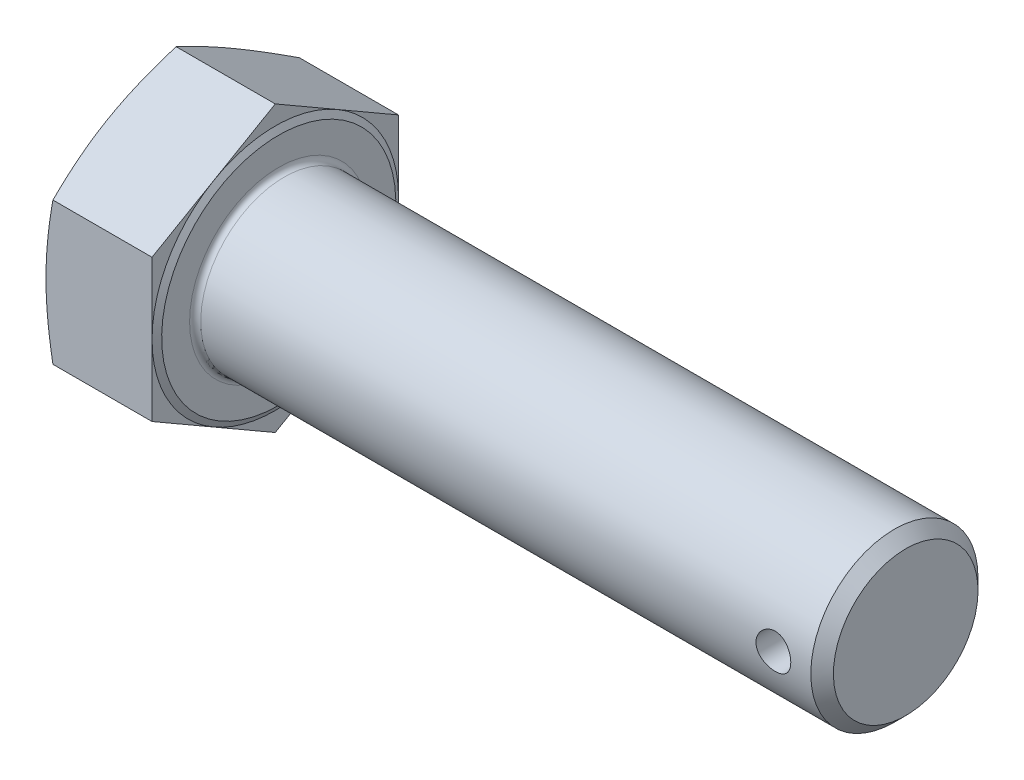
ISO-10303-21;
HEADER;
FILE_DESCRIPTION(('STEP AP214'),'2;1');
FILE_NAME('part.step','',(''),(''),'','','');
FILE_SCHEMA(('AUTOMOTIVE_DESIGN { 1 0 10303 214 1 1 1 1 }'));
ENDSEC;
DATA;
#1=APPLICATION_CONTEXT('core data for automotive mechanical design processes');
#2=APPLICATION_PROTOCOL_DEFINITION('international standard','automotive_design',2000,#1);
#3=PRODUCT_CONTEXT('',#1,'mechanical');
#4=PRODUCT('Part','Part','',(#3));
#5=PRODUCT_RELATED_PRODUCT_CATEGORY('part','',(#4));
#6=PRODUCT_DEFINITION_FORMATION('','',#4);
#7=PRODUCT_DEFINITION_CONTEXT('part definition',#1,'design');
#8=PRODUCT_DEFINITION('design','',#6,#7);
#9=PRODUCT_DEFINITION_SHAPE('','',#8);
#10=(LENGTH_UNIT() NAMED_UNIT(*) SI_UNIT(.MILLI.,.METRE.));
#11=(NAMED_UNIT(*) PLANE_ANGLE_UNIT() SI_UNIT($,.RADIAN.));
#12=(NAMED_UNIT(*) SI_UNIT($,.STERADIAN.) SOLID_ANGLE_UNIT());
#13=UNCERTAINTY_MEASURE_WITH_UNIT(LENGTH_MEASURE(1.E-05),#10,'distance_accuracy_value','');
#14=(GEOMETRIC_REPRESENTATION_CONTEXT(3) GLOBAL_UNCERTAINTY_ASSIGNED_CONTEXT((#13)) GLOBAL_UNIT_ASSIGNED_CONTEXT((#10,
#11,#12)) REPRESENTATION_CONTEXT('',''));
#15=CARTESIAN_POINT('',(0.,0.,0.));
#16=DIRECTION('',(0.,0.,1.));
#17=DIRECTION('',(1.,0.,0.));
#18=AXIS2_PLACEMENT_3D('',#15,#16,#17);
#19=CARTESIAN_POINT('',(15.72,0.,0.));
#20=DIRECTION('',(-1.,0.,0.));
#21=DIRECTION('',(0.,-1.,0.));
#22=AXIS2_PLACEMENT_3D('',#19,#20,#21);
#23=PLANE('',#22);
#24=CARTESIAN_POINT('',(15.72,0.,0.));
#25=DIRECTION('',(-1.,0.,0.));
#26=DIRECTION('',(0.,-1.,0.));
#27=AXIS2_PLACEMENT_3D('',#24,#25,#26);
#28=CIRCLE('',#27,12.8);
#29=CARTESIAN_POINT('',(15.72,-12.8,0.));
#30=VERTEX_POINT('',#29);
#31=EDGE_CURVE('E11',#30,#30,#28,.T.);
#32=ORIENTED_EDGE('',*,*,#31,.T.);
#33=EDGE_LOOP('',(#32));
#34=FACE_BOUND('',#33,.T.);
#35=CARTESIAN_POINT('',(15.72,0.,0.));
#36=DIRECTION('',(-1.,0.,0.));
#37=DIRECTION('',(0.,-1.,0.));
#38=AXIS2_PLACEMENT_3D('',#35,#36,#37);
#39=CIRCLE('',#38,16.805);
#40=CARTESIAN_POINT('',(15.72,-16.805,0.));
#41=VERTEX_POINT('',#40);
#42=EDGE_CURVE('E145',#41,#41,#39,.T.);
#43=ORIENTED_EDGE('',*,*,#42,.F.);
#44=EDGE_LOOP('',(#43));
#45=FACE_BOUND('',#44,.T.);
#46=ADVANCED_FACE('F32',(#34,#45),#23,.F.);
#47=CARTESIAN_POINT('',(15.22,-20.426652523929,0.));
#48=DIRECTION('',(1.,0.,0.));
#49=DIRECTION('',(0.,0.,-1.));
#50=AXIS2_PLACEMENT_3D('',#47,#48,#49);
#51=PLANE('',#50);
#52=DIRECTION('',(0.,-0.5,-0.866025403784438));
#53=VECTOR('',#52,1.);
#54=CARTESIAN_POINT('',(15.22,-10.2133262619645,17.69));
#55=LINE('',#54,#53);
#56=CARTESIAN_POINT('',(15.22,-10.2133262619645,17.69));
#57=VERTEX_POINT('',#56);
#58=CARTESIAN_POINT('',(15.22,-15.3199893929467,8.845));
#59=VERTEX_POINT('',#58);
#60=EDGE_CURVE('E144',#57,#59,#55,.T.);
#61=ORIENTED_EDGE('',*,*,#60,.T.);
#62=CARTESIAN_POINT('',(15.22,0.,0.));
#63=DIRECTION('',(-1.,0.,0.));
#64=DIRECTION('',(0.,-1.,0.));
#65=AXIS2_PLACEMENT_3D('',#62,#63,#64);
#66=CIRCLE('',#65,17.69);
#67=CARTESIAN_POINT('',(15.22,0.,17.69));
#68=VERTEX_POINT('',#67);
#69=EDGE_CURVE('E54',#59,#68,#66,.T.);
#70=ORIENTED_EDGE('',*,*,#69,.T.);
#71=DIRECTION('',(0.,-1.,0.));
#72=VECTOR('',#71,1.);
#73=CARTESIAN_POINT('',(15.22,10.2133262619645,17.69));
#74=LINE('',#73,#72);
#75=EDGE_CURVE('E141',#68,#57,#74,.T.);
#76=ORIENTED_EDGE('',*,*,#75,.T.);
#77=EDGE_LOOP('',(#61,#70,#76));
#78=FACE_BOUND('',#77,.T.);
#79=ADVANCED_FACE('F140',(#78),#51,.T.);
#80=CARTESIAN_POINT('',(15.22,10.2133262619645,17.69));
#81=VERTEX_POINT('',#80);
#82=EDGE_CURVE('E152',#81,#68,#74,.T.);
#83=ORIENTED_EDGE('',*,*,#82,.T.);
#84=CARTESIAN_POINT('',(15.22,15.3199893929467,8.84499999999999));
#85=VERTEX_POINT('',#84);
#86=EDGE_CURVE('E127',#68,#85,#66,.T.);
#87=ORIENTED_EDGE('',*,*,#86,.T.);
#88=DIRECTION('',(0.,-0.5,0.866025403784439));
#89=VECTOR('',#88,1.);
#90=CARTESIAN_POINT('',(15.22,20.426652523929,0.));
#91=LINE('',#90,#89);
#92=EDGE_CURVE('E158',#85,#81,#91,.T.);
#93=ORIENTED_EDGE('',*,*,#92,.T.);
#94=EDGE_LOOP('',(#83,#87,#93));
#95=FACE_BOUND('',#94,.T.);
#96=ADVANCED_FACE('F157',(#95),#51,.T.);
#97=CARTESIAN_POINT('',(15.22,20.426652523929,0.));
#98=VERTEX_POINT('',#97);
#99=EDGE_CURVE('E155',#98,#85,#91,.T.);
#100=ORIENTED_EDGE('',*,*,#99,.T.);
#101=CARTESIAN_POINT('',(15.22,15.3199893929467,-8.845));
#102=VERTEX_POINT('',#101);
#103=EDGE_CURVE('E131',#85,#102,#66,.T.);
#104=ORIENTED_EDGE('',*,*,#103,.T.);
#105=DIRECTION('',(0.,0.5,0.866025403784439));
#106=VECTOR('',#105,1.);
#107=CARTESIAN_POINT('',(15.22,10.2133262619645,-17.69));
#108=LINE('',#107,#106);
#109=EDGE_CURVE('E324',#102,#98,#108,.T.);
#110=ORIENTED_EDGE('',*,*,#109,.T.);
#111=EDGE_LOOP('',(#100,#104,#110));
#112=FACE_BOUND('',#111,.T.);
#113=ADVANCED_FACE('F336',(#112),#51,.T.);
#114=CARTESIAN_POINT('',(15.22,10.2133262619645,-17.69));
#115=VERTEX_POINT('',#114);
#116=EDGE_CURVE('E326',#115,#102,#108,.T.);
#117=ORIENTED_EDGE('',*,*,#116,.T.);
#118=CARTESIAN_POINT('',(15.22,0.,-17.69));
#119=VERTEX_POINT('',#118);
#120=EDGE_CURVE('E379',#102,#119,#66,.T.);
#121=ORIENTED_EDGE('',*,*,#120,.T.);
#122=DIRECTION('',(0.,1.,0.));
#123=VECTOR('',#122,1.);
#124=CARTESIAN_POINT('',(15.22,-10.2133262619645,-17.69));
#125=LINE('',#124,#123);
#126=EDGE_CURVE('E321',#119,#115,#125,.T.);
#127=ORIENTED_EDGE('',*,*,#126,.T.);
#128=EDGE_LOOP('',(#117,#121,#127));
#129=FACE_BOUND('',#128,.T.);
#130=ADVANCED_FACE('F380',(#129),#51,.T.);
#131=CARTESIAN_POINT('',(15.22,-10.2133262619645,-17.69));
#132=VERTEX_POINT('',#131);
#133=EDGE_CURVE('E319',#132,#119,#125,.T.);
#134=ORIENTED_EDGE('',*,*,#133,.T.);
#135=CARTESIAN_POINT('',(15.22,-15.3199893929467,-8.845));
#136=VERTEX_POINT('',#135);
#137=EDGE_CURVE('E363',#119,#136,#66,.T.);
#138=ORIENTED_EDGE('',*,*,#137,.T.);
#139=DIRECTION('',(0.,0.5,-0.866025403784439));
#140=VECTOR('',#139,1.);
#141=CARTESIAN_POINT('',(15.22,-20.426652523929,0.));
#142=LINE('',#141,#140);
#143=EDGE_CURVE('E377',#136,#132,#142,.T.);
#144=ORIENTED_EDGE('',*,*,#143,.T.);
#145=EDGE_LOOP('',(#134,#138,#144));
#146=FACE_BOUND('',#145,.T.);
#147=ADVANCED_FACE('F378',(#146),#51,.T.);
#148=CARTESIAN_POINT('',(15.22,-20.426652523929,0.));
#149=VERTEX_POINT('',#148);
#150=EDGE_CURVE('E327',#149,#136,#142,.T.);
#151=ORIENTED_EDGE('',*,*,#150,.T.);
#152=EDGE_CURVE('E146',#136,#59,#66,.T.);
#153=ORIENTED_EDGE('',*,*,#152,.T.);
#154=EDGE_CURVE('E372',#59,#149,#55,.T.);
#155=ORIENTED_EDGE('',*,*,#154,.T.);
#156=EDGE_LOOP('',(#151,#153,#155));
#157=FACE_BOUND('',#156,.T.);
#158=ADVANCED_FACE('F224',(#157),#51,.T.);
#159=CARTESIAN_POINT('',(15.22,-10.2133262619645,17.69));
#160=DIRECTION('',(0.,0.866025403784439,-0.5));
#161=DIRECTION('',(0.,0.5,0.866025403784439));
#162=AXIS2_PLACEMENT_3D('',#159,#160,#161);
#163=PLANE('',#162);
#164=CARTESIAN_POINT('',(0.996102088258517,-20.4267679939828,-0.000199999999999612));
#165=CARTESIAN_POINT('',(0.919123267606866,-20.2152555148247,0.366150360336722));
#166=CARTESIAN_POINT('',(0.845606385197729,-20.0034321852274,0.73303912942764));
#167=CARTESIAN_POINT('',(0.706258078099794,-19.5791349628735,1.46794347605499));
#168=CARTESIAN_POINT('',(0.640427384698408,-19.366661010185,1.83595915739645));
#169=CARTESIAN_POINT('',(0.455543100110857,-18.7279861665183,2.94217643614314));
#170=CARTESIAN_POINT('',(0.349205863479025,-18.3008246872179,3.68204182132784));
#171=CARTESIAN_POINT('',(0.219971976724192,-17.6606185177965,4.79091143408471));
#172=CARTESIAN_POINT('',(0.182048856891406,-17.4483124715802,5.15863629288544));
#173=CARTESIAN_POINT('',(0.116558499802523,-17.0233039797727,5.89477259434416));
#174=CARTESIAN_POINT('',(0.0889908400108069,-16.8106015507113,6.26318400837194));
#175=CARTESIAN_POINT('',(0.0446929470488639,-16.3849872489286,7.00036960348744));
#176=CARTESIAN_POINT('',(0.0279590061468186,-16.1720754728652,7.36914361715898));
#177=CARTESIAN_POINT('',(0.00561254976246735,-15.7461055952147,8.10694508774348));
#178=CARTESIAN_POINT('',(0.,-15.5330474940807,8.47597254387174));
#179=CARTESIAN_POINT('',(0.,-15.1069312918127,9.21402745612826));
#180=CARTESIAN_POINT('',(0.00561254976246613,-14.8938731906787,9.58305491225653));
#181=CARTESIAN_POINT('',(0.0279590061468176,-14.4679033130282,10.320856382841));
#182=CARTESIAN_POINT('',(0.0446929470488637,-14.2549915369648,10.6896303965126));
#183=CARTESIAN_POINT('',(0.0889908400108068,-13.8293772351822,11.4268159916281));
#184=CARTESIAN_POINT('',(0.116558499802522,-13.6166748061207,11.7952274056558));
#185=CARTESIAN_POINT('',(0.182048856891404,-13.1916663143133,12.5313637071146));
#186=CARTESIAN_POINT('',(0.219971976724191,-12.9793602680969,12.8990885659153));
#187=CARTESIAN_POINT('',(0.349205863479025,-12.3391540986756,14.0079581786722));
#188=CARTESIAN_POINT('',(0.455543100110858,-11.9119926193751,14.7478235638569));
#189=CARTESIAN_POINT('',(0.640427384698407,-11.2733177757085,15.8540408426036));
#190=CARTESIAN_POINT('',(0.706258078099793,-11.06084382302,16.222056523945));
#191=CARTESIAN_POINT('',(0.845606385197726,-10.636546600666,16.9569608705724));
#192=CARTESIAN_POINT('',(0.919123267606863,-10.4247232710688,17.3238496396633));
#193=CARTESIAN_POINT('',(0.996102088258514,-10.2132107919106,17.6902));
#194=B_SPLINE_CURVE_WITH_KNOTS('',3,(#164,#165,#166,#167,#168,#169,#170,#171,#172,#173,#174,
#175,#176,#177,#178,#179,#180,#181,#182,#183,#184,#185,#186,#187,#188,#189,#190,#191,#192,#193),
.UNSPECIFIED.,.F.,.F.,(4,2,2,2,2,2,2,2,2,2,2,2,2,2,4),(0.,1.28987745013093,2.57987752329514,
5.16166096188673,6.44046679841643,7.71922044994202,8.9975362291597,10.2758480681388,
11.554159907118,12.8324756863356,14.1112293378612,15.3900351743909,17.9718186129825,
19.2618186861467,20.5516961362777),.UNSPECIFIED.);
#195=CARTESIAN_POINT('',(0.996060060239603,-20.426652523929,0.));
#196=VERTEX_POINT('',#195);
#197=CARTESIAN_POINT('',(0.,-15.3199893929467,8.845));
#198=VERTEX_POINT('',#197);
#199=EDGE_CURVE('E366',#196,#198,#194,.T.);
#200=ORIENTED_EDGE('',*,*,#199,.F.);
#201=DIRECTION('',(-1.,0.,0.));
#202=VECTOR('',#201,1.);
#203=CARTESIAN_POINT('',(15.22,-20.426652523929,0.));
#204=LINE('',#203,#202);
#205=EDGE_CURVE('E175',#149,#196,#204,.T.);
#206=ORIENTED_EDGE('',*,*,#205,.F.);
#207=ORIENTED_EDGE('',*,*,#154,.F.);
#208=ORIENTED_EDGE('',*,*,#60,.F.);
#209=DIRECTION('',(-1.,0.,0.));
#210=VECTOR('',#209,1.);
#211=CARTESIAN_POINT('',(15.22,-10.2133262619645,17.69));
#212=LINE('',#211,#210);
#213=CARTESIAN_POINT('',(0.996060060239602,-10.2133262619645,17.69));
#214=VERTEX_POINT('',#213);
#215=EDGE_CURVE('E154',#57,#214,#212,.T.);
#216=ORIENTED_EDGE('',*,*,#215,.T.);
#217=EDGE_CURVE('E256',#198,#214,#194,.T.);
#218=ORIENTED_EDGE('',*,*,#217,.F.);
#219=EDGE_LOOP('',(#200,#206,#207,#208,#216,#218));
#220=FACE_BOUND('',#219,.T.);
#221=ADVANCED_FACE('F34',(#220),#163,.F.);
#222=CARTESIAN_POINT('',(15.22,-20.426652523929,0.));
#223=DIRECTION('',(0.,0.866025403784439,0.5));
#224=DIRECTION('',(0.,-0.5,0.866025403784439));
#225=AXIS2_PLACEMENT_3D('',#222,#223,#224);
#226=PLANE('',#225);
#227=CARTESIAN_POINT('',(0.996102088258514,-10.2132107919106,-17.6902));
#228=CARTESIAN_POINT('',(0.919123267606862,-10.4247232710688,-17.3238496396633));
#229=CARTESIAN_POINT('',(0.845606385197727,-10.6365466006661,-16.9569608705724));
#230=CARTESIAN_POINT('',(0.706258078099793,-11.06084382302,-16.222056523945));
#231=CARTESIAN_POINT('',(0.640427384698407,-11.2733177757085,-15.8540408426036));
#232=CARTESIAN_POINT('',(0.455543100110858,-11.9119926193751,-14.7478235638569));
#233=CARTESIAN_POINT('',(0.349205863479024,-12.3391540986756,-14.0079581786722));
#234=CARTESIAN_POINT('',(0.219971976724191,-12.9793602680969,-12.8990885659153));
#235=CARTESIAN_POINT('',(0.182048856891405,-13.1916663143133,-12.5313637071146));
#236=CARTESIAN_POINT('',(0.116558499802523,-13.6166748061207,-11.7952274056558));
#237=CARTESIAN_POINT('',(0.0889908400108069,-13.8293772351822,-11.4268159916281));
#238=CARTESIAN_POINT('',(0.0446929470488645,-14.2549915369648,-10.6896303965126));
#239=CARTESIAN_POINT('',(0.0279590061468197,-14.4679033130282,-10.320856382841));
#240=CARTESIAN_POINT('',(0.00561254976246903,-14.8938731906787,-9.58305491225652));
#241=CARTESIAN_POINT('',(0.,-15.1069312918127,-9.21402745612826));
#242=CARTESIAN_POINT('',(0.,-15.5330474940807,-8.47597254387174));
#243=CARTESIAN_POINT('',(0.00561254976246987,-15.7461055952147,-8.10694508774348));
#244=CARTESIAN_POINT('',(0.0279590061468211,-16.1720754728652,-7.36914361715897));
#245=CARTESIAN_POINT('',(0.044692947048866,-16.3849872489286,-7.00036960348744));
#246=CARTESIAN_POINT('',(0.088990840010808,-16.8106015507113,-6.26318400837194));
#247=CARTESIAN_POINT('',(0.116558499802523,-17.0233039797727,-5.89477259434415));
#248=CARTESIAN_POINT('',(0.182048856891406,-17.4483124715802,-5.15863629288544));
#249=CARTESIAN_POINT('',(0.219971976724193,-17.6606185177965,-4.7909114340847));
#250=CARTESIAN_POINT('',(0.349205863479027,-18.3008246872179,-3.68204182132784));
#251=CARTESIAN_POINT('',(0.455543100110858,-18.7279861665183,-2.94217643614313));
#252=CARTESIAN_POINT('',(0.640427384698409,-19.366661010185,-1.83595915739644));
#253=CARTESIAN_POINT('',(0.706258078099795,-19.5791349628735,-1.46794347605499));
#254=CARTESIAN_POINT('',(0.84560638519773,-20.0034321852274,-0.733039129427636));
#255=CARTESIAN_POINT('',(0.919123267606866,-20.2152555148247,-0.36615036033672));
#256=CARTESIAN_POINT('',(0.996102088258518,-20.4267679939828,0.000199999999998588));
#257=B_SPLINE_CURVE_WITH_KNOTS('',3,(#227,#228,#229,#230,#231,#232,#233,#234,#235,#236,#237,
#238,#239,#240,#241,#242,#243,#244,#245,#246,#247,#248,#249,#250,#251,#252,#253,#254,#255,#256),
.UNSPECIFIED.,.F.,.F.,(4,2,2,2,2,2,2,2,2,2,2,2,2,2,4),(0.,1.28987745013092,2.57987752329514,
5.16166096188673,6.44046679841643,7.71922044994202,8.9975362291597,10.2758480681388,
11.554159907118,12.8324756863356,14.1112293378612,15.3900351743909,17.9718186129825,
19.2618186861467,20.5516961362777),.UNSPECIFIED.);
#258=CARTESIAN_POINT('',(0.996060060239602,-10.2133262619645,-17.69));
#259=VERTEX_POINT('',#258);
#260=CARTESIAN_POINT('',(0.,-15.3199893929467,-8.845));
#261=VERTEX_POINT('',#260);
#262=EDGE_CURVE('E270',#259,#261,#257,.T.);
#263=ORIENTED_EDGE('',*,*,#262,.F.);
#264=DIRECTION('',(-1.,0.,0.));
#265=VECTOR('',#264,1.);
#266=CARTESIAN_POINT('',(15.22,-10.2133262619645,-17.69));
#267=LINE('',#266,#265);
#268=EDGE_CURVE('E172',#132,#259,#267,.T.);
#269=ORIENTED_EDGE('',*,*,#268,.F.);
#270=ORIENTED_EDGE('',*,*,#143,.F.);
#271=ORIENTED_EDGE('',*,*,#150,.F.);
#272=ORIENTED_EDGE('',*,*,#205,.T.);
#273=EDGE_CURVE('E266',#261,#196,#257,.T.);
#274=ORIENTED_EDGE('',*,*,#273,.F.);
#275=EDGE_LOOP('',(#263,#269,#270,#271,#272,#274));
#276=FACE_BOUND('',#275,.T.);
#277=ADVANCED_FACE('F277',(#276),#226,.F.);
#278=CARTESIAN_POINT('',(15.22,-10.2133262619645,-17.69));
#279=DIRECTION('',(0.,0.,1.));
#280=DIRECTION('',(1.,0.,0.));
#281=AXIS2_PLACEMENT_3D('',#278,#279,#280);
#282=PLANE('',#281);
#283=CARTESIAN_POINT('',(5.32254994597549,-27.0412966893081,-17.69));
#284=CARTESIAN_POINT('',(5.20066556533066,-26.64112277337,-17.69));
#285=CARTESIAN_POINT('',(5.07951828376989,-26.2407244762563,-17.69));
#286=CARTESIAN_POINT('',(4.83886293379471,-25.4394331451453,-17.69));
#287=CARTESIAN_POINT('',(4.7193548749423,-25.0385401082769,-17.69));
#288=CARTESIAN_POINT('',(4.36352164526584,-23.8349976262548,-17.69));
#289=CARTESIAN_POINT('',(4.12990548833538,-23.0315439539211,-17.69));
#290=CARTESIAN_POINT('',(3.67113367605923,-21.4205977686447,-17.69));
#291=CARTESIAN_POINT('',(3.44599461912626,-20.613100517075,-17.69));
#292=CARTESIAN_POINT('',(3.00679348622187,-18.9951026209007,-17.69));
#293=CARTESIAN_POINT('',(2.7927312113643,-18.184602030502,-17.69));
#294=CARTESIAN_POINT('',(2.38098718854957,-16.5700722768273,-17.69));
#295=CARTESIAN_POINT('',(2.18313601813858,-15.7660865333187,-17.69));
#296=CARTESIAN_POINT('',(1.80427806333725,-14.1541143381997,-17.69));
#297=CARTESIAN_POINT('',(1.62327156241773,-13.3461278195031,-17.69));
#298=CARTESIAN_POINT('',(1.28232330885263,-11.7259732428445,-17.69));
#299=CARTESIAN_POINT('',(1.12237437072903,-10.9138067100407,-17.69));
#300=CARTESIAN_POINT('',(0.82841153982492,-9.28475845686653,-17.69));
#301=CARTESIAN_POINT('',(0.69439677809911,-8.46787689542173,-17.69));
#302=CARTESIAN_POINT('',(0.471016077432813,-6.92138265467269,-17.69));
#303=CARTESIAN_POINT('',(0.378328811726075,-6.19225422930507,-17.69));
#304=CARTESIAN_POINT('',(0.221431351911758,-4.73091426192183,-17.69));
#305=CARTESIAN_POINT('',(0.157220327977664,-3.99870281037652,-17.69));
#306=CARTESIAN_POINT('',(0.0603676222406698,-2.5326819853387,-17.69));
#307=CARTESIAN_POINT('',(0.0277036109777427,-1.79887411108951,-17.69));
#308=CARTESIAN_POINT('',(-0.00440129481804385,-0.330524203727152,-17.69));
#309=CARTESIAN_POINT('',(-0.00384242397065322,0.404017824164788,-17.69));
#310=CARTESIAN_POINT('',(0.0305550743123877,1.87603656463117,-17.69));
#311=CARTESIAN_POINT('',(0.0645624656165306,2.61350926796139,-17.69));
#312=CARTESIAN_POINT('',(0.164291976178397,4.08628853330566,-17.69));
#313=CARTESIAN_POINT('',(0.230014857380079,4.8215950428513,-17.69));
#314=CARTESIAN_POINT('',(0.390100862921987,6.28967883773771,-17.69));
#315=CARTESIAN_POINT('',(0.484488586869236,7.02245340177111,-17.69));
#316=CARTESIAN_POINT('',(0.698075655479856,8.48433663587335,-17.69));
#317=CARTESIAN_POINT('',(0.817275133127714,9.21344528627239,-17.69));
#318=CARTESIAN_POINT('',(1.08346543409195,10.7063636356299,-17.69));
#319=CARTESIAN_POINT('',(1.23159277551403,11.4699688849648,-17.69));
#320=CARTESIAN_POINT('',(1.54691232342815,12.9932580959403,-17.69));
#321=CARTESIAN_POINT('',(1.71410596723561,13.7529417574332,-17.69));
#322=CARTESIAN_POINT('',(2.0640473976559,15.2689291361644,-17.69));
#323=CARTESIAN_POINT('',(2.246799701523,16.0252318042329,-17.69));
#324=CARTESIAN_POINT('',(2.62488561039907,17.5346511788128,-17.69));
#325=CARTESIAN_POINT('',(2.82021891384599,18.2877679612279,-17.69));
#326=CARTESIAN_POINT('',(3.22137256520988,19.792229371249,-17.69));
#327=CARTESIAN_POINT('',(3.42720605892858,20.5435704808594,-17.69));
#328=CARTESIAN_POINT('',(3.84724615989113,22.0439053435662,-17.69));
#329=CARTESIAN_POINT('',(4.06145280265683,22.7928990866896,-17.69));
#330=CARTESIAN_POINT('',(4.49670654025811,24.2887557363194,-17.69));
#331=CARTESIAN_POINT('',(4.71775248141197,25.0356189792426,-17.69));
#332=CARTESIAN_POINT('',(5.16553110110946,26.5276341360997,-17.69));
#333=CARTESIAN_POINT('',(5.39226376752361,27.27278605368,-17.69));
#334=CARTESIAN_POINT('',(5.84793743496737,28.7534099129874,-17.69));
#335=CARTESIAN_POINT('',(6.07682640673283,29.4888978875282,-17.69));
#336=CARTESIAN_POINT('',(6.53850831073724,30.9586483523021,-17.69));
#337=CARTESIAN_POINT('',(6.7713012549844,31.6929108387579,-17.69));
#338=CARTESIAN_POINT('',(7.47463001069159,33.8941870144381,-17.69));
#339=CARTESIAN_POINT('',(7.95009616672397,35.3596261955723,-17.69));
#340=CARTESIAN_POINT('',(8.66958601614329,37.5526335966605,-17.69));
#341=CARTESIAN_POINT('',(8.90999982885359,38.2813921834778,-17.69));
#342=CARTESIAN_POINT('',(9.39290673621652,39.7382212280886,-17.69));
#343=CARTESIAN_POINT('',(9.63539983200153,40.466291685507,-17.69));
#344=CARTESIAN_POINT('',(10.1221661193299,41.9217705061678,-17.69));
#345=CARTESIAN_POINT('',(10.366439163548,42.6491789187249,-17.69));
#346=CARTESIAN_POINT('',(10.8565658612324,44.103461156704,-17.69));
#347=CARTESIAN_POINT('',(11.102419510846,44.8303349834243,-17.69));
#348=CARTESIAN_POINT('',(11.3489545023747,45.556977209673,-17.69));
#349=B_SPLINE_CURVE_WITH_KNOTS('',3,(#283,#284,#285,#286,#287,#288,#289,#290,#291,#292,#293,
#294,#295,#296,#297,#298,#299,#300,#301,#302,#303,#304,#305,#306,#307,#308,#309,#310,#311,#312,
#313,#314,#315,#316,#317,#318,#319,#320,#321,#322,#323,#324,#325,#326,#327,#328,#329,#330,#331,
#332,#333,#334,#335,#336,#337,#338,#339,#340,#341,#342,#343,#344,#345,#346,#347,#348),
.UNSPECIFIED.,.F.,.F.,(4,2,2,2,2,2,2,2,2,2,2,2,2,2,2,2,2,2,2,2,2,2,2,2,2,2,2,2,2,2,2,2,4),(0.,
1.25497065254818,2.50994862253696,5.02009008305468,7.53491484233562,10.0496944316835,
12.53346810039,15.0172835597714,17.5002492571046,19.9831317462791,22.1876358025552,
24.3920756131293,26.5949539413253,28.7978167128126,31.0118513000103,33.2259390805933,
35.4419323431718,37.6579374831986,39.9911583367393,42.3245551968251,44.6586318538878,
46.9926525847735,49.3296707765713,51.6666988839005,54.0033348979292,56.339965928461,
58.6507957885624,60.9616327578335,65.5835052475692,67.8856747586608,70.1878455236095,
72.4898278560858,74.7918045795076),.UNSPECIFIED.);
#350=CARTESIAN_POINT('',(0.996060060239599,10.2133262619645,-17.69));
#351=VERTEX_POINT('',#350);
#352=CARTESIAN_POINT('',(0.,0.,-17.69));
#353=VERTEX_POINT('',#352);
#354=EDGE_CURVE('E311',#351,#353,#349,.F.);
#355=ORIENTED_EDGE('',*,*,#354,.F.);
#356=DIRECTION('',(-1.,0.,0.));
#357=VECTOR('',#356,1.);
#358=CARTESIAN_POINT('',(15.22,10.2133262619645,-17.69));
#359=LINE('',#358,#357);
#360=EDGE_CURVE('E169',#115,#351,#359,.T.);
#361=ORIENTED_EDGE('',*,*,#360,.F.);
#362=ORIENTED_EDGE('',*,*,#126,.F.);
#363=ORIENTED_EDGE('',*,*,#133,.F.);
#364=ORIENTED_EDGE('',*,*,#268,.T.);
#365=EDGE_CURVE('E271',#353,#259,#349,.F.);
#366=ORIENTED_EDGE('',*,*,#365,.F.);
#367=EDGE_LOOP('',(#355,#361,#362,#363,#364,#366));
#368=FACE_BOUND('',#367,.T.);
#369=ADVANCED_FACE('F280',(#368),#282,.F.);
#370=CARTESIAN_POINT('',(15.22,10.2133262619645,-17.69));
#371=DIRECTION('',(0.,-0.866025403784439,0.5));
#372=DIRECTION('',(0.,-0.5,-0.866025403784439));
#373=AXIS2_PLACEMENT_3D('',#370,#371,#372);
#374=PLANE('',#373);
#375=CARTESIAN_POINT('',(0.996102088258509,20.4267679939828,0.000199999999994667));
#376=CARTESIAN_POINT('',(0.919123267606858,20.2152555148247,-0.366150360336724));
#377=CARTESIAN_POINT('',(0.845606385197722,20.0034321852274,-0.73303912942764));
#378=CARTESIAN_POINT('',(0.706258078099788,19.5791349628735,-1.46794347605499));
#379=CARTESIAN_POINT('',(0.640427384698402,19.366661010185,-1.83595915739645));
#380=CARTESIAN_POINT('',(0.455543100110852,18.7279861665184,-2.94217643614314));
#381=CARTESIAN_POINT('',(0.34920586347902,18.3008246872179,-3.68204182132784));
#382=CARTESIAN_POINT('',(0.219971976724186,17.6606185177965,-4.79091143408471));
#383=CARTESIAN_POINT('',(0.1820488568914,17.4483124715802,-5.15863629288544));
#384=CARTESIAN_POINT('',(0.116558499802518,17.0233039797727,-5.89477259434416));
#385=CARTESIAN_POINT('',(0.0889908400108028,16.8106015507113,-6.26318400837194));
#386=CARTESIAN_POINT('',(0.0446929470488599,16.3849872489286,-7.00036960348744));
#387=CARTESIAN_POINT('',(0.0279590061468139,16.1720754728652,-7.36914361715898));
#388=CARTESIAN_POINT('',(0.00561254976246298,15.7461055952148,-8.10694508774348));
#389=CARTESIAN_POINT('',(0.,15.5330474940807,-8.47597254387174));
#390=CARTESIAN_POINT('',(0.,15.1069312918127,-9.21402745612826));
#391=CARTESIAN_POINT('',(0.00561254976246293,14.8938731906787,-9.58305491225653));
#392=CARTESIAN_POINT('',(0.0279590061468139,14.4679033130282,-10.320856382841));
#393=CARTESIAN_POINT('',(0.04469294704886,14.2549915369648,-10.6896303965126));
#394=CARTESIAN_POINT('',(0.088990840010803,13.8293772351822,-11.4268159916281));
#395=CARTESIAN_POINT('',(0.116558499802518,13.6166748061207,-11.7952274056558));
#396=CARTESIAN_POINT('',(0.182048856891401,13.1916663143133,-12.5313637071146));
#397=CARTESIAN_POINT('',(0.219971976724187,12.9793602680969,-12.8990885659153));
#398=CARTESIAN_POINT('',(0.349205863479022,12.3391540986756,-14.0079581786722));
#399=CARTESIAN_POINT('',(0.455543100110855,11.9119926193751,-14.7478235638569));
#400=CARTESIAN_POINT('',(0.640427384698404,11.2733177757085,-15.8540408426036));
#401=CARTESIAN_POINT('',(0.706258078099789,11.06084382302,-16.222056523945));
#402=CARTESIAN_POINT('',(0.845606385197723,10.6365466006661,-16.9569608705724));
#403=CARTESIAN_POINT('',(0.919123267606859,10.4247232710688,-17.3238496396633));
#404=CARTESIAN_POINT('',(0.996102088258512,10.2132107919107,-17.6902));
#405=B_SPLINE_CURVE_WITH_KNOTS('',3,(#375,#376,#377,#378,#379,#380,#381,#382,#383,#384,#385,
#386,#387,#388,#389,#390,#391,#392,#393,#394,#395,#396,#397,#398,#399,#400,#401,#402,#403,#404),
.UNSPECIFIED.,.F.,.F.,(4,2,2,2,2,2,2,2,2,2,2,2,2,2,4),(0.,1.28987745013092,2.57987752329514,
5.16166096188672,6.44046679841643,7.71922044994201,8.9975362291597,10.2758480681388,
11.554159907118,12.8324756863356,14.1112293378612,15.3900351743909,17.9718186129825,
19.2618186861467,20.5516961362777),.UNSPECIFIED.);
#406=CARTESIAN_POINT('',(0.996060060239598,20.426652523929,0.));
#407=VERTEX_POINT('',#406);
#408=CARTESIAN_POINT('',(0.,15.3199893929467,-8.845));
#409=VERTEX_POINT('',#408);
#410=EDGE_CURVE('E62',#407,#409,#405,.T.);
#411=ORIENTED_EDGE('',*,*,#410,.F.);
#412=DIRECTION('',(-1.,0.,0.));
#413=VECTOR('',#412,1.);
#414=CARTESIAN_POINT('',(15.22,20.426652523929,0.));
#415=LINE('',#414,#413);
#416=EDGE_CURVE('E166',#98,#407,#415,.T.);
#417=ORIENTED_EDGE('',*,*,#416,.F.);
#418=ORIENTED_EDGE('',*,*,#109,.F.);
#419=ORIENTED_EDGE('',*,*,#116,.F.);
#420=ORIENTED_EDGE('',*,*,#360,.T.);
#421=EDGE_CURVE('E312',#409,#351,#405,.T.);
#422=ORIENTED_EDGE('',*,*,#421,.F.);
#423=EDGE_LOOP('',(#411,#417,#418,#419,#420,#422));
#424=FACE_BOUND('',#423,.T.);
#425=ADVANCED_FACE('F284',(#424),#374,.F.);
#426=CARTESIAN_POINT('',(15.22,20.426652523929,0.));
#427=DIRECTION('',(0.,-0.866025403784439,-0.5));
#428=DIRECTION('',(0.,0.5,-0.866025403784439));
#429=AXIS2_PLACEMENT_3D('',#426,#427,#428);
#430=PLANE('',#429);
#431=CARTESIAN_POINT('',(0.996102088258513,10.2132107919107,17.6902));
#432=CARTESIAN_POINT('',(0.919123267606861,10.4247232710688,17.3238496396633));
#433=CARTESIAN_POINT('',(0.845606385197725,10.6365466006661,16.9569608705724));
#434=CARTESIAN_POINT('',(0.706258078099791,11.06084382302,16.222056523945));
#435=CARTESIAN_POINT('',(0.640427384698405,11.2733177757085,15.8540408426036));
#436=CARTESIAN_POINT('',(0.455543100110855,11.9119926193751,14.7478235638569));
#437=CARTESIAN_POINT('',(0.349205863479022,12.3391540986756,14.0079581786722));
#438=CARTESIAN_POINT('',(0.219971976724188,12.9793602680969,12.8990885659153));
#439=CARTESIAN_POINT('',(0.182048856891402,13.1916663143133,12.5313637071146));
#440=CARTESIAN_POINT('',(0.116558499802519,13.6166748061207,11.7952274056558));
#441=CARTESIAN_POINT('',(0.088990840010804,13.8293772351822,11.4268159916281));
#442=CARTESIAN_POINT('',(0.0446929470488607,14.2549915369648,10.6896303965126));
#443=CARTESIAN_POINT('',(0.0279590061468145,14.4679033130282,10.320856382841));
#444=CARTESIAN_POINT('',(0.00561254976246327,14.8938731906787,9.58305491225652));
#445=CARTESIAN_POINT('',(0.,15.1069312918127,9.21402745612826));
#446=CARTESIAN_POINT('',(0.,15.5330474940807,8.47597254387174));
#447=CARTESIAN_POINT('',(0.00561254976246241,15.7461055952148,8.10694508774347));
#448=CARTESIAN_POINT('',(0.0279590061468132,16.1720754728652,7.36914361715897));
#449=CARTESIAN_POINT('',(0.0446929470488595,16.3849872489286,7.00036960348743));
#450=CARTESIAN_POINT('',(0.0889908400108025,16.8106015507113,6.26318400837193));
#451=CARTESIAN_POINT('',(0.116558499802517,17.0233039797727,5.89477259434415));
#452=CARTESIAN_POINT('',(0.1820488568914,17.4483124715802,5.15863629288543));
#453=CARTESIAN_POINT('',(0.219971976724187,17.6606185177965,4.7909114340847));
#454=CARTESIAN_POINT('',(0.349205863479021,18.3008246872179,3.68204182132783));
#455=CARTESIAN_POINT('',(0.455543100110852,18.7279861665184,2.94217643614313));
#456=CARTESIAN_POINT('',(0.640427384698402,19.366661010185,1.83595915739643));
#457=CARTESIAN_POINT('',(0.706258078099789,19.5791349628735,1.46794347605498));
#458=CARTESIAN_POINT('',(0.845606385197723,20.0034321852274,0.733039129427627));
#459=CARTESIAN_POINT('',(0.919123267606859,20.2152555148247,0.36615036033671));
#460=CARTESIAN_POINT('',(0.99610208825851,20.4267679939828,-0.000200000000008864));
#461=B_SPLINE_CURVE_WITH_KNOTS('',3,(#431,#432,#433,#434,#435,#436,#437,#438,#439,#440,#441,
#442,#443,#444,#445,#446,#447,#448,#449,#450,#451,#452,#453,#454,#455,#456,#457,#458,#459,#460),
.UNSPECIFIED.,.F.,.F.,(4,2,2,2,2,2,2,2,2,2,2,2,2,2,4),(0.,1.28987745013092,2.57987752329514,
5.16166096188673,6.44046679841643,7.71922044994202,8.9975362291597,10.2758480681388,
11.554159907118,12.8324756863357,14.1112293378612,15.3900351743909,17.9718186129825,
19.2618186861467,20.5516961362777),.UNSPECIFIED.);
#462=CARTESIAN_POINT('',(0.996060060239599,10.2133262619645,17.69));
#463=VERTEX_POINT('',#462);
#464=CARTESIAN_POINT('',(0.,15.3199893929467,8.84499999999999));
#465=VERTEX_POINT('',#464);
#466=EDGE_CURVE('E249',#463,#465,#461,.T.);
#467=ORIENTED_EDGE('',*,*,#466,.F.);
#468=DIRECTION('',(-1.,0.,0.));
#469=VECTOR('',#468,1.);
#470=CARTESIAN_POINT('',(15.22,10.2133262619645,17.69));
#471=LINE('',#470,#469);
#472=EDGE_CURVE('E160',#81,#463,#471,.T.);
#473=ORIENTED_EDGE('',*,*,#472,.F.);
#474=ORIENTED_EDGE('',*,*,#92,.F.);
#475=ORIENTED_EDGE('',*,*,#99,.F.);
#476=ORIENTED_EDGE('',*,*,#416,.T.);
#477=EDGE_CURVE('E371',#465,#407,#461,.T.);
#478=ORIENTED_EDGE('',*,*,#477,.F.);
#479=EDGE_LOOP('',(#467,#473,#474,#475,#476,#478));
#480=FACE_BOUND('',#479,.T.);
#481=ADVANCED_FACE('F288',(#480),#430,.F.);
#482=CARTESIAN_POINT('',(15.22,10.2133262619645,17.69));
#483=DIRECTION('',(0.,0.,-1.));
#484=DIRECTION('',(0.,1.,0.));
#485=AXIS2_PLACEMENT_3D('',#482,#483,#484);
#486=PLANE('',#485);
#487=CARTESIAN_POINT('',(5.32254994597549,-27.0412966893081,17.69));
#488=CARTESIAN_POINT('',(5.20066556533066,-26.64112277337,17.69));
#489=CARTESIAN_POINT('',(5.07951828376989,-26.2407244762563,17.69));
#490=CARTESIAN_POINT('',(4.83886293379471,-25.4394331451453,17.69));
#491=CARTESIAN_POINT('',(4.7193548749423,-25.0385401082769,17.69));
#492=CARTESIAN_POINT('',(4.36352164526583,-23.8349976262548,17.69));
#493=CARTESIAN_POINT('',(4.12990548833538,-23.0315439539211,17.69));
#494=CARTESIAN_POINT('',(3.67113367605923,-21.4205977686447,17.69));
#495=CARTESIAN_POINT('',(3.44599461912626,-20.613100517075,17.69));
#496=CARTESIAN_POINT('',(3.00679348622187,-18.9951026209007,17.69));
#497=CARTESIAN_POINT('',(2.7927312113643,-18.184602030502,17.69));
#498=CARTESIAN_POINT('',(2.38098718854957,-16.5700722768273,17.69));
#499=CARTESIAN_POINT('',(2.18313601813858,-15.7660865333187,17.69));
#500=CARTESIAN_POINT('',(1.80427806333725,-14.1541143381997,17.69));
#501=CARTESIAN_POINT('',(1.62327156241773,-13.3461278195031,17.69));
#502=CARTESIAN_POINT('',(1.28232330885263,-11.7259732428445,17.69));
#503=CARTESIAN_POINT('',(1.12237437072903,-10.9138067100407,17.69));
#504=CARTESIAN_POINT('',(0.828411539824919,-9.28475845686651,17.69));
#505=CARTESIAN_POINT('',(0.694396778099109,-8.46787689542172,17.69));
#506=CARTESIAN_POINT('',(0.471016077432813,-6.92138265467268,17.69));
#507=CARTESIAN_POINT('',(0.378328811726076,-6.19225422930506,17.69));
#508=CARTESIAN_POINT('',(0.221431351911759,-4.73091426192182,17.69));
#509=CARTESIAN_POINT('',(0.157220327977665,-3.99870281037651,17.69));
#510=CARTESIAN_POINT('',(0.0603676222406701,-2.5326819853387,17.69));
#511=CARTESIAN_POINT('',(0.0277036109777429,-1.7988741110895,17.69));
#512=CARTESIAN_POINT('',(-0.0044012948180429,-0.330524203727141,17.69));
#513=CARTESIAN_POINT('',(-0.0038424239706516,0.404017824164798,17.69));
#514=CARTESIAN_POINT('',(0.03055507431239,1.87603656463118,17.69));
#515=CARTESIAN_POINT('',(0.0645624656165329,2.6135092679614,17.69));
#516=CARTESIAN_POINT('',(0.164291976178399,4.08628853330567,17.69));
#517=CARTESIAN_POINT('',(0.230014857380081,4.82159504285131,17.69));
#518=CARTESIAN_POINT('',(0.390100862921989,6.28967883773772,17.69));
#519=CARTESIAN_POINT('',(0.48448858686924,7.02245340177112,17.69));
#520=CARTESIAN_POINT('',(0.69807565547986,8.48433663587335,17.69));
#521=CARTESIAN_POINT('',(0.817275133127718,9.2134452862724,17.69));
#522=CARTESIAN_POINT('',(1.08346543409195,10.7063636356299,17.69));
#523=CARTESIAN_POINT('',(1.23159277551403,11.4699688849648,17.69));
#524=CARTESIAN_POINT('',(1.54691232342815,12.9932580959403,17.69));
#525=CARTESIAN_POINT('',(1.71410596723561,13.7529417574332,17.69));
#526=CARTESIAN_POINT('',(2.0640473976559,15.2689291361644,17.69));
#527=CARTESIAN_POINT('',(2.246799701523,16.0252318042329,17.69));
#528=CARTESIAN_POINT('',(2.62488561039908,17.5346511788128,17.69));
#529=CARTESIAN_POINT('',(2.82021891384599,18.2877679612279,17.69));
#530=CARTESIAN_POINT('',(3.22137256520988,19.792229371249,17.69));
#531=CARTESIAN_POINT('',(3.42720605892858,20.5435704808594,17.69));
#532=CARTESIAN_POINT('',(3.84724615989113,22.0439053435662,17.69));
#533=CARTESIAN_POINT('',(4.06145280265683,22.7928990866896,17.69));
#534=CARTESIAN_POINT('',(4.49670654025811,24.2887557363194,17.69));
#535=CARTESIAN_POINT('',(4.71775248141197,25.0356189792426,17.69));
#536=CARTESIAN_POINT('',(5.16553110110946,26.5276341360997,17.69));
#537=CARTESIAN_POINT('',(5.39226376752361,27.27278605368,17.69));
#538=CARTESIAN_POINT('',(5.84793743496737,28.7534099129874,17.69));
#539=CARTESIAN_POINT('',(6.07682640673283,29.4888978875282,17.69));
#540=CARTESIAN_POINT('',(6.53850831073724,30.958648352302,17.69));
#541=CARTESIAN_POINT('',(6.77130125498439,31.6929108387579,17.69));
#542=CARTESIAN_POINT('',(7.47463001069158,33.894187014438,17.69));
#543=CARTESIAN_POINT('',(7.95009616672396,35.3596261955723,17.69));
#544=CARTESIAN_POINT('',(8.66958601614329,37.5526335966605,17.69));
#545=CARTESIAN_POINT('',(8.90999982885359,38.2813921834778,17.69));
#546=CARTESIAN_POINT('',(9.39290673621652,39.7382212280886,17.69));
#547=CARTESIAN_POINT('',(9.63539983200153,40.466291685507,17.69));
#548=CARTESIAN_POINT('',(10.1221661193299,41.9217705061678,17.69));
#549=CARTESIAN_POINT('',(10.366439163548,42.6491789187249,17.69));
#550=CARTESIAN_POINT('',(10.8565658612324,44.103461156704,17.69));
#551=CARTESIAN_POINT('',(11.102419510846,44.8303349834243,17.69));
#552=CARTESIAN_POINT('',(11.3489545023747,45.556977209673,17.69));
#553=B_SPLINE_CURVE_WITH_KNOTS('',3,(#487,#488,#489,#490,#491,#492,#493,#494,#495,#496,#497,
#498,#499,#500,#501,#502,#503,#504,#505,#506,#507,#508,#509,#510,#511,#512,#513,#514,#515,#516,
#517,#518,#519,#520,#521,#522,#523,#524,#525,#526,#527,#528,#529,#530,#531,#532,#533,#534,#535,
#536,#537,#538,#539,#540,#541,#542,#543,#544,#545,#546,#547,#548,#549,#550,#551,#552),
.UNSPECIFIED.,.F.,.F.,(4,2,2,2,2,2,2,2,2,2,2,2,2,2,2,2,2,2,2,2,2,2,2,2,2,2,2,2,2,2,2,2,4),(0.,
1.25497065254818,2.50994862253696,5.02009008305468,7.53491484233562,10.0496944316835,
12.53346810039,15.0172835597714,17.5002492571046,19.9831317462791,22.1876358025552,
24.3920756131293,26.5949539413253,28.7978167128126,31.0118513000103,33.2259390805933,
35.4419323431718,37.6579374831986,39.9911583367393,42.3245551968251,44.6586318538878,
46.9926525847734,49.3296707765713,51.6666988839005,54.0033348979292,56.339965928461,
58.6507957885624,60.9616327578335,65.5835052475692,67.8856747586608,70.1878455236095,
72.4898278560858,74.7918045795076),.UNSPECIFIED.);
#554=CARTESIAN_POINT('',(0.,0.,17.69));
#555=VERTEX_POINT('',#554);
#556=EDGE_CURVE('E343',#214,#555,#553,.T.);
#557=ORIENTED_EDGE('',*,*,#556,.F.);
#558=ORIENTED_EDGE('',*,*,#215,.F.);
#559=ORIENTED_EDGE('',*,*,#75,.F.);
#560=ORIENTED_EDGE('',*,*,#82,.F.);
#561=ORIENTED_EDGE('',*,*,#472,.T.);
#562=EDGE_CURVE('E239',#555,#463,#553,.T.);
#563=ORIENTED_EDGE('',*,*,#562,.F.);
#564=EDGE_LOOP('',(#557,#558,#559,#560,#561,#563));
#565=FACE_BOUND('',#564,.T.);
#566=ADVANCED_FACE('F150',(#565),#486,.F.);
#567=CARTESIAN_POINT('',(0.,0.,0.));
#568=DIRECTION('',(1.,0.,0.));
#569=DIRECTION('',(0.,1.,0.));
#570=AXIS2_PLACEMENT_3D('',#567,#568,#569);
#571=CONICAL_SURFACE('',#570,17.69,1.22173047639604);
#572=ORIENTED_EDGE('',*,*,#365,.T.);
#573=ORIENTED_EDGE('',*,*,#262,.T.);
#574=CARTESIAN_POINT('',(0.,0.,0.));
#575=DIRECTION('',(1.,0.,0.));
#576=DIRECTION('',(0.,0.,-1.));
#577=AXIS2_PLACEMENT_3D('',#574,#575,#576);
#578=CIRCLE('',#577,17.69);
#579=EDGE_CURVE('E178',#261,#353,#578,.T.);
#580=ORIENTED_EDGE('',*,*,#579,.T.);
#581=EDGE_LOOP('',(#572,#573,#580));
#582=FACE_BOUND('',#581,.T.);
#583=ADVANCED_FACE('F234',(#582),#571,.T.);
#584=ORIENTED_EDGE('',*,*,#273,.T.);
#585=ORIENTED_EDGE('',*,*,#199,.T.);
#586=EDGE_CURVE('E181',#198,#261,#578,.T.);
#587=ORIENTED_EDGE('',*,*,#586,.T.);
#588=EDGE_LOOP('',(#584,#585,#587));
#589=FACE_BOUND('',#588,.T.);
#590=ADVANCED_FACE('F298',(#589),#571,.T.);
#591=ORIENTED_EDGE('',*,*,#217,.T.);
#592=ORIENTED_EDGE('',*,*,#556,.T.);
#593=CARTESIAN_POINT('',(0.,0.,0.));
#594=DIRECTION('',(-1.,0.,0.));
#595=DIRECTION('',(0.,-1.,0.));
#596=AXIS2_PLACEMENT_3D('',#593,#594,#595);
#597=CIRCLE('',#596,17.69);
#598=EDGE_CURVE('E346',#198,#555,#597,.T.);
#599=ORIENTED_EDGE('',*,*,#598,.F.);
#600=EDGE_LOOP('',(#591,#592,#599));
#601=FACE_BOUND('',#600,.T.);
#602=ADVANCED_FACE('F303',(#601),#571,.T.);
#603=ORIENTED_EDGE('',*,*,#466,.T.);
#604=EDGE_CURVE('E364',#465,#555,#578,.T.);
#605=ORIENTED_EDGE('',*,*,#604,.T.);
#606=ORIENTED_EDGE('',*,*,#562,.T.);
#607=EDGE_LOOP('',(#603,#605,#606));
#608=FACE_BOUND('',#607,.T.);
#609=ADVANCED_FACE('F235',(#608),#571,.T.);
#610=ORIENTED_EDGE('',*,*,#410,.T.);
#611=EDGE_CURVE('E361',#409,#465,#578,.T.);
#612=ORIENTED_EDGE('',*,*,#611,.T.);
#613=ORIENTED_EDGE('',*,*,#477,.T.);
#614=EDGE_LOOP('',(#610,#612,#613));
#615=FACE_BOUND('',#614,.T.);
#616=ADVANCED_FACE('F232',(#615),#571,.T.);
#617=ORIENTED_EDGE('',*,*,#354,.T.);
#618=EDGE_CURVE('E182',#353,#409,#578,.T.);
#619=ORIENTED_EDGE('',*,*,#618,.T.);
#620=ORIENTED_EDGE('',*,*,#421,.T.);
#621=EDGE_LOOP('',(#617,#619,#620));
#622=FACE_BOUND('',#621,.T.);
#623=ADVANCED_FACE('F227',(#622),#571,.T.);
#624=CARTESIAN_POINT('',(0.,-20.426652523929,0.));
#625=DIRECTION('',(1.,0.,0.));
#626=DIRECTION('',(0.,0.,-1.));
#627=AXIS2_PLACEMENT_3D('',#624,#625,#626);
#628=PLANE('',#627);
#629=ORIENTED_EDGE('',*,*,#618,.F.);
#630=ORIENTED_EDGE('',*,*,#579,.F.);
#631=ORIENTED_EDGE('',*,*,#586,.F.);
#632=ORIENTED_EDGE('',*,*,#598,.T.);
#633=ORIENTED_EDGE('',*,*,#604,.F.);
#634=ORIENTED_EDGE('',*,*,#611,.F.);
#635=EDGE_LOOP('',(#629,#630,#631,#632,#633,#634));
#636=FACE_BOUND('',#635,.T.);
#637=ADVANCED_FACE('F231',(#636),#628,.F.);
#638=CARTESIAN_POINT('',(15.72,0.,0.));
#639=DIRECTION('',(-1.,0.,0.));
#640=DIRECTION('',(0.,-1.,0.));
#641=AXIS2_PLACEMENT_3D('',#638,#639,#640);
#642=CONICAL_SURFACE('',#641,16.805,1.05653119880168);
#643=ORIENTED_EDGE('',*,*,#69,.F.);
#644=ORIENTED_EDGE('',*,*,#152,.F.);
#645=ORIENTED_EDGE('',*,*,#137,.F.);
#646=ORIENTED_EDGE('',*,*,#120,.F.);
#647=ORIENTED_EDGE('',*,*,#103,.F.);
#648=ORIENTED_EDGE('',*,*,#86,.F.);
#649=EDGE_LOOP('',(#643,#644,#645,#646,#647,#648));
#650=FACE_BOUND('',#649,.T.);
#651=ORIENTED_EDGE('',*,*,#42,.T.);
#652=EDGE_LOOP('',(#651));
#653=FACE_BOUND('',#652,.T.);
#654=ADVANCED_FACE('F128',(#650,#653),#642,.T.);
#655=CARTESIAN_POINT('',(105.72,0.,0.));
#656=DIRECTION('',(-1.,0.,0.));
#657=DIRECTION('',(0.,-1.,0.));
#658=AXIS2_PLACEMENT_3D('',#655,#656,#657);
#659=CYLINDRICAL_SURFACE('',#658,12.);
#660=CARTESIAN_POINT('',(101.22,0.,-12.));
#661=CARTESIAN_POINT('',(101.219995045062,0.138818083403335,-11.999997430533));
#662=CARTESIAN_POINT('',(101.208398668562,0.277697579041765,-11.9975665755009));
#663=CARTESIAN_POINT('',(101.162361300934,0.551522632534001,-11.9881040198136));
#664=CARTESIAN_POINT('',(101.127902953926,0.686465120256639,-11.981068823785));
#665=CARTESIAN_POINT('',(101.037259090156,0.948418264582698,-11.963182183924));
#666=CARTESIAN_POINT('',(100.981095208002,1.07543667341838,-11.9523345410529));
#667=CARTESIAN_POINT('',(100.848700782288,1.31824065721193,-11.9279985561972));
#668=CARTESIAN_POINT('',(100.772471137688,1.43402673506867,-11.9145103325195));
#669=CARTESIAN_POINT('',(100.600927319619,1.65278064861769,-11.886154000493));
#670=CARTESIAN_POINT('',(100.50537599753,1.75556048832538,-11.8712701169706));
#671=CARTESIAN_POINT('',(100.29841068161,1.9437555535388,-11.841913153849));
#672=CARTESIAN_POINT('',(100.186995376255,2.02916934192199,-11.8274401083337));
#673=CARTESIAN_POINT('',(99.9500960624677,2.18102063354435,-11.8003888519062));
#674=CARTESIAN_POINT('',(99.8244832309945,2.24726109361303,-11.7878309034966));
#675=CARTESIAN_POINT('',(99.5636050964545,2.35762238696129,-11.7662568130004));
#676=CARTESIAN_POINT('',(99.4283408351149,2.40174560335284,-11.7572402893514));
#677=CARTESIAN_POINT('',(99.1540295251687,2.46600480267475,-11.7439300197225));
#678=CARTESIAN_POINT('',(99.0150632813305,2.48647195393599,-11.7395711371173));
#679=CARTESIAN_POINT('',(98.7356063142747,2.5038671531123,-11.7358738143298));
#680=CARTESIAN_POINT('',(98.5951157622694,2.50079781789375,-11.7365348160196));
#681=CARTESIAN_POINT('',(98.3190379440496,2.47147438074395,-11.7427434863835));
#682=CARTESIAN_POINT('',(98.1834080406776,2.44560210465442,-11.748210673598));
#683=CARTESIAN_POINT('',(97.9184569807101,2.37201087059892,-11.7632887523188));
#684=CARTESIAN_POINT('',(97.7891361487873,2.32429078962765,-11.7728998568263));
#685=CARTESIAN_POINT('',(97.539385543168,2.20800006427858,-11.795263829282));
#686=CARTESIAN_POINT('',(97.4190274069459,2.13928005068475,-11.8080390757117));
#687=CARTESIAN_POINT('',(97.1914085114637,1.98304539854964,-11.8352778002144));
#688=CARTESIAN_POINT('',(97.0841493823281,1.89552842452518,-11.8497414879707));
#689=CARTESIAN_POINT('',(96.8835720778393,1.70214984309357,-11.8790746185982));
#690=CARTESIAN_POINT('',(96.790567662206,1.59596286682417,-11.8939464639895));
#691=CARTESIAN_POINT('',(96.6236391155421,1.3693345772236,-11.92216176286));
#692=CARTESIAN_POINT('',(96.5497152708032,1.24889305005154,-11.9355051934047));
#693=CARTESIAN_POINT('',(96.4229798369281,0.996811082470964,-11.9591974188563));
#694=CARTESIAN_POINT('',(96.3702063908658,0.865150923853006,-11.9695407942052));
#695=CARTESIAN_POINT('',(96.287616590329,0.594569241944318,-11.9860267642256));
#696=CARTESIAN_POINT('',(96.2577972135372,0.455648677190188,-11.9921699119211));
#697=CARTESIAN_POINT('',(96.2224114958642,0.177183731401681,-11.9994855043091));
#698=CARTESIAN_POINT('',(96.2164161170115,0.0376961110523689,-12.0007458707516));
#699=CARTESIAN_POINT('',(96.2276898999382,-0.240287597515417,-11.9983990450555));
#700=CARTESIAN_POINT('',(96.2449576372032,-0.378783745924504,-11.9947921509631));
#701=CARTESIAN_POINT('',(96.3019113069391,-0.649452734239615,-11.9831712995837));
#702=CARTESIAN_POINT('',(96.3413749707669,-0.781674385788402,-11.9752010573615));
#703=CARTESIAN_POINT('',(96.4413557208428,-1.03762289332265,-11.9557445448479));
#704=CARTESIAN_POINT('',(96.501874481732,-1.16134907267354,-11.9442579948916));
#705=CARTESIAN_POINT('',(96.6431607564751,-1.39858861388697,-11.9188248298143));
#706=CARTESIAN_POINT('',(96.7241838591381,-1.51194643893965,-11.9048478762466));
#707=CARTESIAN_POINT('',(96.9038391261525,-1.72361089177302,-11.8760513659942));
#708=CARTESIAN_POINT('',(97.0024733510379,-1.82191575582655,-11.8612317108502));
#709=CARTESIAN_POINT('',(97.2165111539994,-2.00235729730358,-11.8321204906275));
#710=CARTESIAN_POINT('',(97.3321660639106,-2.08419829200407,-11.81784178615));
#711=CARTESIAN_POINT('',(97.5758325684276,-2.22729438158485,-11.7917120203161));
#712=CARTESIAN_POINT('',(97.7038436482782,-2.28855033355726,-11.779860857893));
#713=CARTESIAN_POINT('',(97.9679223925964,-2.38834492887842,-11.7600340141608));
#714=CARTESIAN_POINT('',(98.1039420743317,-2.42700619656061,-11.7520374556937));
#715=CARTESIAN_POINT('',(98.3807331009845,-2.48088077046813,-11.7407836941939));
#716=CARTESIAN_POINT('',(98.5215037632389,-2.4960974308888,-11.7375258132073));
#717=CARTESIAN_POINT('',(98.8008268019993,-2.50251852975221,-11.7361581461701));
#718=CARTESIAN_POINT('',(98.9393681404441,-2.49419085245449,-11.73794804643));
#719=CARTESIAN_POINT('',(99.2130280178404,-2.45479810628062,-11.7462489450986));
#720=CARTESIAN_POINT('',(99.3481465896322,-2.4237332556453,-11.7527598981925));
#721=CARTESIAN_POINT('',(99.6107955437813,-2.33996435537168,-11.7697226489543));
#722=CARTESIAN_POINT('',(99.7383464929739,-2.28732235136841,-11.7801631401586));
#723=CARTESIAN_POINT('',(99.9828775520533,-2.16194914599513,-11.8038141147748));
#724=CARTESIAN_POINT('',(100.099856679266,-2.08921607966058,-11.8170248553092));
#725=CARTESIAN_POINT('',(100.322243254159,-1.9241473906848,-11.8450315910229));
#726=CARTESIAN_POINT('',(100.42739824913,-1.83147578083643,-11.8598522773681));
#727=CARTESIAN_POINT('',(100.620818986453,-1.62984887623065,-11.8892367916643));
#728=CARTESIAN_POINT('',(100.709080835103,-1.52088983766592,-11.9038005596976));
#729=CARTESIAN_POINT('',(100.867177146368,-1.28826885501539,-11.9312288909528));
#730=CARTESIAN_POINT('',(100.936787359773,-1.16445184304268,-11.9440719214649));
#731=CARTESIAN_POINT('',(101.05410045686,-0.906639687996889,-11.9663981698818));
#732=CARTESIAN_POINT('',(101.101822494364,-0.772653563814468,-11.975884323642));
#733=CARTESIAN_POINT('',(101.165080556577,-0.532030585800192,-11.9886499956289));
#734=CARTESIAN_POINT('',(101.185637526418,-0.426735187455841,-11.9928807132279));
#735=CARTESIAN_POINT('',(101.213098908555,-0.214305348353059,-11.9985566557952));
#736=CARTESIAN_POINT('',(101.220003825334,-0.107170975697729,-12.0000019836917));
#737=CARTESIAN_POINT('',(101.22,0.,-12.));
#738=B_SPLINE_CURVE_WITH_KNOTS('',3,(#660,#661,#662,#663,#664,#665,#666,#667,#668,#669,#670,
#671,#672,#673,#674,#675,#676,#677,#678,#679,#680,#681,#682,#683,#684,#685,#686,#687,#688,#689,
#690,#691,#692,#693,#694,#695,#696,#697,#698,#699,#700,#701,#702,#703,#704,#705,#706,#707,#708,
#709,#710,#711,#712,#713,#714,#715,#716,#717,#718,#719,#720,#721,#722,#723,#724,#725,#726,#727,
#728,#729,#730,#731,#732,#733,#734,#735,#736,#737),.UNSPECIFIED.,.T.,.F.,(4,2,2,2,2,2,2,2,2,2,2,
2,2,2,2,2,2,2,2,2,2,2,2,2,2,2,2,2,2,2,2,2,2,2,2,2,2,2,4),(0.,0.416062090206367,0.83244039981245,
1.24840475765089,1.66435048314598,2.08575052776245,2.50718543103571,2.93280898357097,
3.3583866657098,3.77793150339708,4.19742969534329,4.61003424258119,5.02266000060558,
5.43829184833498,5.85397536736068,6.27779052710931,6.70161204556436,7.12619448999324,
7.55072102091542,7.9675667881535,8.38438703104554,8.79710573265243,9.20985726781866,
9.62803167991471,10.0462550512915,10.4714252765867,10.8965777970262,11.3194010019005,
11.7421637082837,12.1565844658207,12.5710012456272,12.9842346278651,13.3975063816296,
13.8183804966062,14.2393515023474,14.6651772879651,15.0906297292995,15.4118517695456,
15.7330619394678),.UNSPECIFIED.);
#739=CARTESIAN_POINT('',(101.22,0.,-12.));
#740=VERTEX_POINT('',#739);
#741=EDGE_CURVE('E37',#740,#740,#738,.T.);
#742=ORIENTED_EDGE('',*,*,#741,.T.);
#743=EDGE_LOOP('',(#742));
#744=FACE_BOUND('',#743,.T.);
#745=CARTESIAN_POINT('',(101.22,0.,12.));
#746=CARTESIAN_POINT('',(101.219995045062,-0.138818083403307,11.999997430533));
#747=CARTESIAN_POINT('',(101.208398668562,-0.277697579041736,11.9975665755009));
#748=CARTESIAN_POINT('',(101.162361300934,-0.551522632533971,11.9881040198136));
#749=CARTESIAN_POINT('',(101.127902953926,-0.68646512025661,11.981068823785));
#750=CARTESIAN_POINT('',(101.037259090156,-0.94841826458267,11.963182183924));
#751=CARTESIAN_POINT('',(100.981095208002,-1.07543667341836,11.9523345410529));
#752=CARTESIAN_POINT('',(100.848700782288,-1.3182406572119,11.9279985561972));
#753=CARTESIAN_POINT('',(100.772471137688,-1.43402673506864,11.9145103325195));
#754=CARTESIAN_POINT('',(100.600927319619,-1.65278064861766,11.886154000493));
#755=CARTESIAN_POINT('',(100.50537599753,-1.75556048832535,11.8712701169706));
#756=CARTESIAN_POINT('',(100.29841068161,-1.94375555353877,11.841913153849));
#757=CARTESIAN_POINT('',(100.186995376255,-2.02916934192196,11.8274401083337));
#758=CARTESIAN_POINT('',(99.9500960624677,-2.18102063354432,11.8003888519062));
#759=CARTESIAN_POINT('',(99.8244832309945,-2.247261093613,11.7878309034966));
#760=CARTESIAN_POINT('',(99.5636050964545,-2.35762238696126,11.7662568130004));
#761=CARTESIAN_POINT('',(99.4283408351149,-2.40174560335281,11.7572402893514));
#762=CARTESIAN_POINT('',(99.1540295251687,-2.46600480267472,11.7439300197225));
#763=CARTESIAN_POINT('',(99.0150632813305,-2.48647195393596,11.7395711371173));
#764=CARTESIAN_POINT('',(98.7356063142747,-2.50386715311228,11.7358738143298));
#765=CARTESIAN_POINT('',(98.5951157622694,-2.50079781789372,11.7365348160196));
#766=CARTESIAN_POINT('',(98.3190379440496,-2.47147438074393,11.7427434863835));
#767=CARTESIAN_POINT('',(98.1834080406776,-2.44560210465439,11.748210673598));
#768=CARTESIAN_POINT('',(97.9184569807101,-2.37201087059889,11.7632887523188));
#769=CARTESIAN_POINT('',(97.7891361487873,-2.32429078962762,11.7728998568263));
#770=CARTESIAN_POINT('',(97.539385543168,-2.20800006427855,11.795263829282));
#771=CARTESIAN_POINT('',(97.4190274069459,-2.13928005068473,11.8080390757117));
#772=CARTESIAN_POINT('',(97.1914085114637,-1.98304539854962,11.8352778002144));
#773=CARTESIAN_POINT('',(97.0841493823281,-1.89552842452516,11.8497414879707));
#774=CARTESIAN_POINT('',(96.8835720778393,-1.70214984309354,11.8790746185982));
#775=CARTESIAN_POINT('',(96.790567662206,-1.59596286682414,11.8939464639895));
#776=CARTESIAN_POINT('',(96.6236391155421,-1.36933457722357,11.92216176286));
#777=CARTESIAN_POINT('',(96.5497152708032,-1.24889305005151,11.9355051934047));
#778=CARTESIAN_POINT('',(96.4229798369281,-0.996811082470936,11.9591974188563));
#779=CARTESIAN_POINT('',(96.3702063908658,-0.865150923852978,11.9695407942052));
#780=CARTESIAN_POINT('',(96.287616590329,-0.59456924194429,11.9860267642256));
#781=CARTESIAN_POINT('',(96.2577972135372,-0.45564867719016,11.9921699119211));
#782=CARTESIAN_POINT('',(96.2224114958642,-0.177183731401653,11.9994855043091));
#783=CARTESIAN_POINT('',(96.2164161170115,-0.0376961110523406,12.0007458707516));
#784=CARTESIAN_POINT('',(96.2276898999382,0.240287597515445,11.9983990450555));
#785=CARTESIAN_POINT('',(96.2449576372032,0.378783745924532,11.9947921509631));
#786=CARTESIAN_POINT('',(96.3019113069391,0.649452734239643,11.9831712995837));
#787=CARTESIAN_POINT('',(96.3413749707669,0.781674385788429,11.9752010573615));
#788=CARTESIAN_POINT('',(96.4413557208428,1.03762289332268,11.9557445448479));
#789=CARTESIAN_POINT('',(96.501874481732,1.16134907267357,11.9442579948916));
#790=CARTESIAN_POINT('',(96.6431607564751,1.398588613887,11.9188248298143));
#791=CARTESIAN_POINT('',(96.7241838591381,1.51194643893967,11.9048478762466));
#792=CARTESIAN_POINT('',(96.9038391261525,1.72361089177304,11.8760513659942));
#793=CARTESIAN_POINT('',(97.0024733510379,1.82191575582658,11.8612317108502));
#794=CARTESIAN_POINT('',(97.2165111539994,2.00235729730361,11.8321204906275));
#795=CARTESIAN_POINT('',(97.3321660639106,2.0841982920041,11.81784178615));
#796=CARTESIAN_POINT('',(97.5758325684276,2.22729438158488,11.7917120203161));
#797=CARTESIAN_POINT('',(97.7038436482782,2.28855033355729,11.779860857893));
#798=CARTESIAN_POINT('',(97.9679223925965,2.38834492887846,11.7600340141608));
#799=CARTESIAN_POINT('',(98.1039420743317,2.42700619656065,11.7520374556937));
#800=CARTESIAN_POINT('',(98.3807331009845,2.48088077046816,11.7407836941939));
#801=CARTESIAN_POINT('',(98.5215037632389,2.49609743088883,11.7375258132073));
#802=CARTESIAN_POINT('',(98.8008268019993,2.50251852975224,11.7361581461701));
#803=CARTESIAN_POINT('',(98.9393681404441,2.49419085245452,11.73794804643));
#804=CARTESIAN_POINT('',(99.2130280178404,2.45479810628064,11.7462489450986));
#805=CARTESIAN_POINT('',(99.3481465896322,2.42373325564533,11.7527598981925));
#806=CARTESIAN_POINT('',(99.6107955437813,2.33996435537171,11.7697226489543));
#807=CARTESIAN_POINT('',(99.7383464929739,2.28732235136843,11.7801631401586));
#808=CARTESIAN_POINT('',(99.9828775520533,2.16194914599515,11.8038141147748));
#809=CARTESIAN_POINT('',(100.099856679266,2.08921607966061,11.8170248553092));
#810=CARTESIAN_POINT('',(100.322243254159,1.92414739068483,11.8450315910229));
#811=CARTESIAN_POINT('',(100.42739824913,1.83147578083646,11.8598522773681));
#812=CARTESIAN_POINT('',(100.620818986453,1.62984887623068,11.8892367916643));
#813=CARTESIAN_POINT('',(100.709080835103,1.52088983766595,11.9038005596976));
#814=CARTESIAN_POINT('',(100.867177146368,1.28826885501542,11.9312288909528));
#815=CARTESIAN_POINT('',(100.936787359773,1.16445184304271,11.9440719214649));
#816=CARTESIAN_POINT('',(101.05410045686,0.906639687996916,11.9663981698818));
#817=CARTESIAN_POINT('',(101.101822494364,0.772653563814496,11.975884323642));
#818=CARTESIAN_POINT('',(101.165080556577,0.53203058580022,11.9886499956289));
#819=CARTESIAN_POINT('',(101.185637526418,0.426735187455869,11.9928807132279));
#820=CARTESIAN_POINT('',(101.213098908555,0.214305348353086,11.9985566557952));
#821=CARTESIAN_POINT('',(101.220003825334,0.107170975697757,12.0000019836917));
#822=CARTESIAN_POINT('',(101.22,0.,12.));
#823=B_SPLINE_CURVE_WITH_KNOTS('',3,(#745,#746,#747,#748,#749,#750,#751,#752,#753,#754,#755,
#756,#757,#758,#759,#760,#761,#762,#763,#764,#765,#766,#767,#768,#769,#770,#771,#772,#773,#774,
#775,#776,#777,#778,#779,#780,#781,#782,#783,#784,#785,#786,#787,#788,#789,#790,#791,#792,#793,
#794,#795,#796,#797,#798,#799,#800,#801,#802,#803,#804,#805,#806,#807,#808,#809,#810,#811,#812,
#813,#814,#815,#816,#817,#818,#819,#820,#821,#822),.UNSPECIFIED.,.T.,.F.,(4,2,2,2,2,2,2,2,2,2,2,
2,2,2,2,2,2,2,2,2,2,2,2,2,2,2,2,2,2,2,2,2,2,2,2,2,2,2,4),(0.,0.416062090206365,0.83244039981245,
1.24840475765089,1.66435048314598,2.08575052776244,2.50718543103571,2.93280898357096,
3.3583866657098,3.77793150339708,4.19742969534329,4.61003424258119,5.02266000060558,
5.43829184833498,5.85397536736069,6.27779052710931,6.70161204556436,7.12619448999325,
7.55072102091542,7.9675667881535,8.38438703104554,8.79710573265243,9.20985726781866,
9.62803167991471,10.0462550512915,10.4714252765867,10.8965777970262,11.3194010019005,
11.7421637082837,12.1565844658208,12.5710012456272,12.9842346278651,13.3975063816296,
13.8183804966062,14.2393515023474,14.6651772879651,15.0906297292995,15.4118517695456,
15.7330619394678),.UNSPECIFIED.);
#824=CARTESIAN_POINT('',(101.22,0.,12.));
#825=VERTEX_POINT('',#824);
#826=EDGE_CURVE('E189',#825,#825,#823,.T.);
#827=ORIENTED_EDGE('',*,*,#826,.T.);
#828=EDGE_LOOP('',(#827));
#829=FACE_BOUND('',#828,.T.);
#830=CARTESIAN_POINT('',(16.52,0.,0.));
#831=DIRECTION('',(-1.,0.,0.));
#832=DIRECTION('',(0.,-1.,0.));
#833=AXIS2_PLACEMENT_3D('',#830,#831,#832);
#834=CIRCLE('',#833,12.);
#835=CARTESIAN_POINT('',(16.52,-12.,0.));
#836=VERTEX_POINT('',#835);
#837=EDGE_CURVE('E46',#836,#836,#834,.F.);
#838=ORIENTED_EDGE('',*,*,#837,.T.);
#839=EDGE_LOOP('',(#838));
#840=FACE_BOUND('',#839,.T.);
#841=CARTESIAN_POINT('',(104.096,0.,0.));
#842=DIRECTION('',(1.,0.,0.));
#843=DIRECTION('',(0.,1.,0.));
#844=AXIS2_PLACEMENT_3D('',#841,#842,#843);
#845=CIRCLE('',#844,12.);
#846=CARTESIAN_POINT('',(104.096,12.,0.));
#847=VERTEX_POINT('',#846);
#848=EDGE_CURVE('E185',#847,#847,#845,.F.);
#849=ORIENTED_EDGE('',*,*,#848,.T.);
#850=EDGE_LOOP('',(#849));
#851=FACE_BOUND('',#850,.T.);
#852=ADVANCED_FACE('F193',(#744,#829,#840,#851),#659,.T.);
#853=CARTESIAN_POINT('',(105.72,0.,0.));
#854=DIRECTION('',(1.,0.,0.));
#855=DIRECTION('',(0.,1.,0.));
#856=AXIS2_PLACEMENT_3D('',#853,#854,#855);
#857=PLANE('',#856);
#858=CARTESIAN_POINT('',(105.72,0.,0.));
#859=DIRECTION('',(1.,0.,0.));
#860=DIRECTION('',(0.,1.,0.));
#861=AXIS2_PLACEMENT_3D('',#858,#859,#860);
#862=CIRCLE('',#861,10.3760000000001);
#863=CARTESIAN_POINT('',(105.72,10.3760000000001,0.));
#864=VERTEX_POINT('',#863);
#865=EDGE_CURVE('E135',#864,#864,#862,.T.);
#866=ORIENTED_EDGE('',*,*,#865,.T.);
#867=EDGE_LOOP('',(#866));
#868=FACE_BOUND('',#867,.T.);
#869=ADVANCED_FACE('F209',(#868),#857,.T.);
#870=CARTESIAN_POINT('',(105.72,0.,0.));
#871=DIRECTION('',(-1.,0.,0.));
#872=DIRECTION('',(0.,-1.,0.));
#873=AXIS2_PLACEMENT_3D('',#870,#871,#872);
#874=CONICAL_SURFACE('',#873,10.3760000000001,0.785398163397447);
#875=ORIENTED_EDGE('',*,*,#848,.F.);
#876=EDGE_LOOP('',(#875));
#877=FACE_BOUND('',#876,.T.);
#878=ORIENTED_EDGE('',*,*,#865,.F.);
#879=EDGE_LOOP('',(#878));
#880=FACE_BOUND('',#879,.T.);
#881=ADVANCED_FACE('F206',(#877,#880),#874,.T.);
#882=CARTESIAN_POINT('',(16.52,0.,0.));
#883=DIRECTION('',(-1.,0.,0.));
#884=DIRECTION('',(0.,-1.,0.));
#885=AXIS2_PLACEMENT_3D('',#882,#883,#884);
#886=TOROIDAL_SURFACE('',#885,12.8,0.8);
#887=ORIENTED_EDGE('',*,*,#31,.F.);
#888=EDGE_LOOP('',(#887));
#889=FACE_BOUND('',#888,.T.);
#890=ORIENTED_EDGE('',*,*,#837,.F.);
#891=EDGE_LOOP('',(#890));
#892=FACE_BOUND('',#891,.T.);
#893=ADVANCED_FACE('F201',(#889,#892),#886,.F.);
#894=CARTESIAN_POINT('',(98.72,0.,-17.69));
#895=DIRECTION('',(0.,0.,1.));
#896=DIRECTION('',(1.,0.,0.));
#897=AXIS2_PLACEMENT_3D('',#894,#895,#896);
#898=CYLINDRICAL_SURFACE('',#897,2.5);
#899=ORIENTED_EDGE('',*,*,#826,.F.);
#900=EDGE_LOOP('',(#899));
#901=FACE_BOUND('',#900,.T.);
#902=ORIENTED_EDGE('',*,*,#741,.F.);
#903=EDGE_LOOP('',(#902));
#904=FACE_BOUND('',#903,.T.);
#905=ADVANCED_FACE('F197',(#901,#904),#898,.F.);
#906=CLOSED_SHELL('',(#46,#79,#96,#113,#130,#147,#158,#221,#277,#369,#425,#481,#566,#583,#590,
#602,#609,#616,#623,#637,#654,#852,#869,#881,#893,#905));
#907=MANIFOLD_SOLID_BREP('B2',#906);
#908=ADVANCED_BREP_SHAPE_REPRESENTATION('',(#18,#907),#14);
#909=SHAPE_DEFINITION_REPRESENTATION(#9,#908);
ENDSEC;
END-ISO-10303-21;
